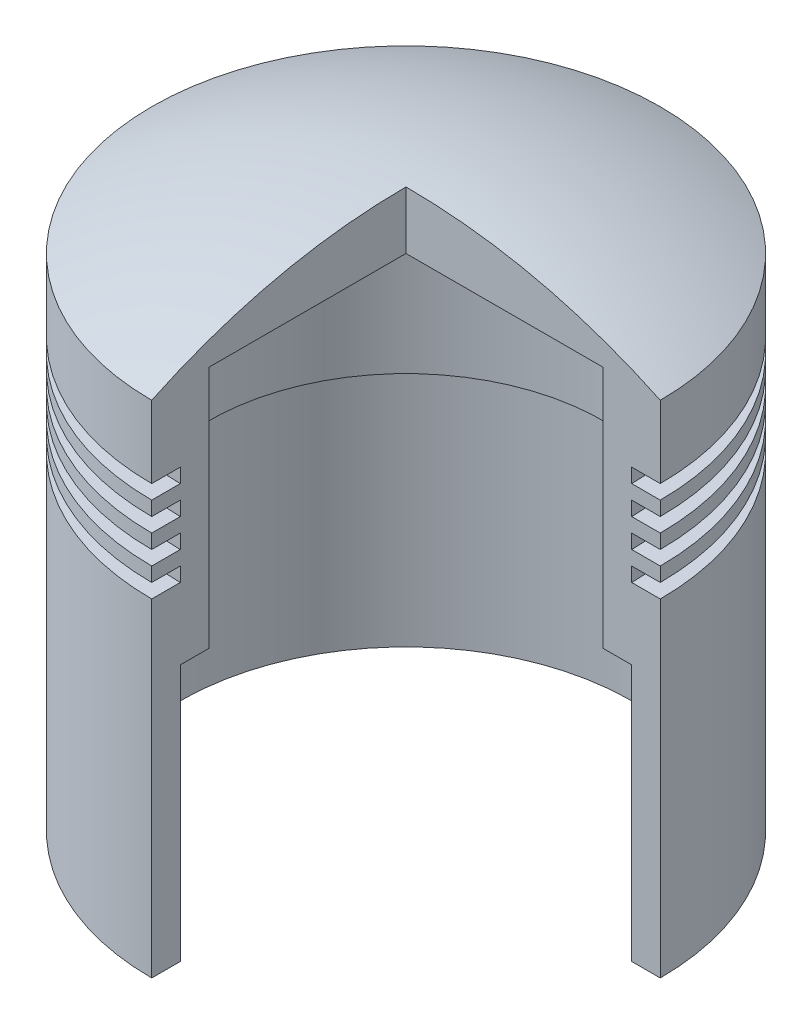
from build123d import *

# Parameters (mm, degrees)
REVOLVE1_ANGLE = 270


with BuildPart() as part:
    # Sketch1 → Revolve1 (revolve)
    with BuildSketch(Plane.XY):
        with BuildLine():
            Line((34.539251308, 89.908336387), (0, 89.908336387))
            Line((0, 89.908336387), (0, 100))
            ThreePointArc((0, 100), (22.834111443, 97.445509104), (44.539251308, 89.908336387))
            Line((44.539251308, 89.908336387), (44.539251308, 77.264054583))
            Line((44.539251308, 77.264054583), (39.539251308, 77.264054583))
            Line((39.539251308, 77.264054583), (39.539251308, 74.764054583))
            Line((39.539251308, 74.764054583), (44.539251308, 74.764054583))
            Line((44.539251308, 74.764054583), (44.539251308, 72.264054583))
            Line((44.539251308, 72.264054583), (39.539251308, 72.264054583))
            Line((39.539251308, 72.264054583), (39.539251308, 69.764054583))
            Line((39.539251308, 69.764054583), (44.539251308, 69.764054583))
            Line((44.539251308, 69.764054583), (44.539251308, 67.264054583))
            Line((44.539251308, 67.264054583), (39.539251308, 67.264054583))
            Line((39.539251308, 67.264054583), (39.539251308, 64.764054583))
            Line((39.539251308, 64.764054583), (44.539251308, 64.764054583))
            Line((44.539251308, 64.764054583), (44.539251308, 62.264054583))
            Line((44.539251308, 62.264054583), (39.539251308, 62.264054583))
            Line((39.539251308, 62.264054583), (39.539251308, 59.764054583))
            Line((39.539251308, 59.764054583), (44.539251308, 59.764054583))
            Line((44.539251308, 59.764054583), (44.539251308, 2.264054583))
            Line((44.539251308, 2.264054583), (39.539251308, 2.264054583))
            Line((39.539251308, 2.264054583), (39.539251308, 47.264054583))
            Line((39.539251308, 47.264054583), (34.539251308, 47.264054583))
            Line((34.539251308, 47.264054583), (34.539251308, 89.908336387))
        make_face()
    revolve(axis=Axis((0, 89.908336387, 0), (0, 1, 0)), revolution_arc=REVOLVE1_ANGLE)


solid = part.part
